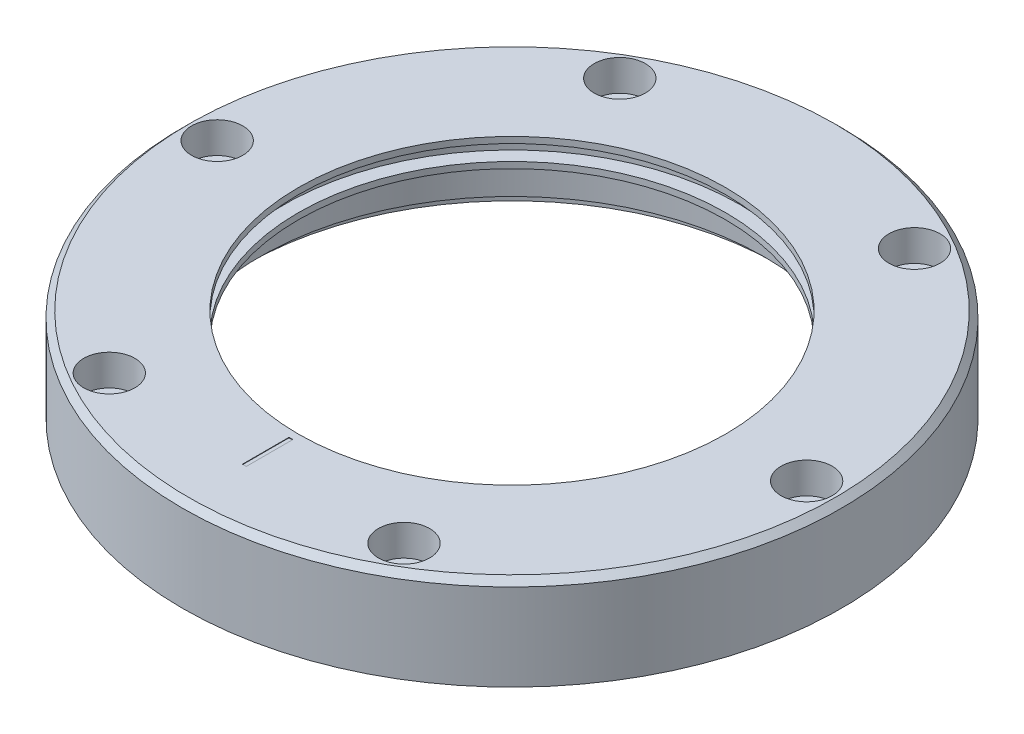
ISO-10303-21;
HEADER;
FILE_DESCRIPTION(('STEP AP214'),'2;1');
FILE_NAME('part.step','',(''),(''),'','','');
FILE_SCHEMA(('AUTOMOTIVE_DESIGN { 1 0 10303 214 1 1 1 1 }'));
ENDSEC;
DATA;
#1=APPLICATION_CONTEXT('core data for automotive mechanical design processes');
#2=APPLICATION_PROTOCOL_DEFINITION('international standard','automotive_design',2000,#1);
#3=PRODUCT_CONTEXT('',#1,'mechanical');
#4=PRODUCT('Part','Part','',(#3));
#5=PRODUCT_RELATED_PRODUCT_CATEGORY('part','',(#4));
#6=PRODUCT_DEFINITION_FORMATION('','',#4);
#7=PRODUCT_DEFINITION_CONTEXT('part definition',#1,'design');
#8=PRODUCT_DEFINITION('design','',#6,#7);
#9=PRODUCT_DEFINITION_SHAPE('','',#8);
#10=(LENGTH_UNIT() NAMED_UNIT(*) SI_UNIT(.MILLI.,.METRE.));
#11=(NAMED_UNIT(*) PLANE_ANGLE_UNIT() SI_UNIT($,.RADIAN.));
#12=(NAMED_UNIT(*) SI_UNIT($,.STERADIAN.) SOLID_ANGLE_UNIT());
#13=UNCERTAINTY_MEASURE_WITH_UNIT(LENGTH_MEASURE(1.E-05),#10,'distance_accuracy_value','');
#14=(GEOMETRIC_REPRESENTATION_CONTEXT(3) GLOBAL_UNCERTAINTY_ASSIGNED_CONTEXT((#13)) GLOBAL_UNIT_ASSIGNED_CONTEXT((#10,
#11,#12)) REPRESENTATION_CONTEXT('',''));
#15=CARTESIAN_POINT('',(0.,0.,0.));
#16=DIRECTION('',(0.,0.,1.));
#17=DIRECTION('',(1.,0.,0.));
#18=AXIS2_PLACEMENT_3D('',#15,#16,#17);
#19=CARTESIAN_POINT('',(-0.0234141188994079,54.2010599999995,-152.4));
#20=DIRECTION('',(0.,-1.,0.));
#21=DIRECTION('',(0.,0.,-1.));
#22=AXIS2_PLACEMENT_3D('',#19,#20,#21);
#23=CYLINDRICAL_SURFACE('',#22,34.9758);
#24=CARTESIAN_POINT('',(-0.0234141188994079,54.7090599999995,-152.4));
#25=DIRECTION('',(0.,-1.,0.));
#26=DIRECTION('',(0.,0.,-1.));
#27=AXIS2_PLACEMENT_3D('',#24,#25,#26);
#28=CIRCLE('',#27,34.9758);
#29=CARTESIAN_POINT('',(-0.0234141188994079,54.7090599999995,-187.3758));
#30=VERTEX_POINT('',#29);
#31=EDGE_CURVE('E20',#30,#30,#28,.T.);
#32=ORIENTED_EDGE('',*,*,#31,.F.);
#33=EDGE_LOOP('',(#32));
#34=FACE_BOUND('',#33,.T.);
#35=CARTESIAN_POINT('',(-0.0234141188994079,53.6930599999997,-152.4));
#36=DIRECTION('',(0.,-1.,0.));
#37=DIRECTION('',(0.,0.,-1.));
#38=AXIS2_PLACEMENT_3D('',#35,#36,#37);
#39=CIRCLE('',#38,34.9758);
#40=CARTESIAN_POINT('',(-0.0234141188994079,53.6930599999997,-187.3758));
#41=VERTEX_POINT('',#40);
#42=EDGE_CURVE('E187',#41,#41,#39,.F.);
#43=ORIENTED_EDGE('',*,*,#42,.F.);
#44=EDGE_LOOP('',(#43));
#45=FACE_BOUND('',#44,.T.);
#46=ADVANCED_FACE('F17',(#34,#45),#23,.F.);
#47=CARTESIAN_POINT('',(37.2637858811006,54.7090599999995,-152.4));
#48=DIRECTION('',(0.,1.,0.));
#49=DIRECTION('',(0.,0.,1.));
#50=AXIS2_PLACEMENT_3D('',#47,#48,#49);
#51=PLANE('',#50);
#52=ORIENTED_EDGE('',*,*,#31,.T.);
#53=EDGE_LOOP('',(#52));
#54=FACE_BOUND('',#53,.T.);
#55=CARTESIAN_POINT('',(-0.0234141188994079,54.7090599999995,-152.4));
#56=DIRECTION('',(0.,-1.,0.));
#57=DIRECTION('',(0.,0.,-1.));
#58=AXIS2_PLACEMENT_3D('',#55,#56,#57);
#59=CIRCLE('',#58,37.2872);
#60=CARTESIAN_POINT('',(-0.0234141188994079,54.7090599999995,-189.6872));
#61=VERTEX_POINT('',#60);
#62=EDGE_CURVE('E185',#61,#61,#59,.F.);
#63=ORIENTED_EDGE('',*,*,#62,.T.);
#64=EDGE_LOOP('',(#63));
#65=FACE_BOUND('',#64,.T.);
#66=ADVANCED_FACE('F194',(#54,#65),#51,.T.);
#67=CARTESIAN_POINT('',(34.9523858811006,53.6930599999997,-152.4));
#68=DIRECTION('',(0.,-1.,0.));
#69=DIRECTION('',(0.,0.,-1.));
#70=AXIS2_PLACEMENT_3D('',#67,#68,#69);
#71=PLANE('',#70);
#72=ORIENTED_EDGE('',*,*,#42,.T.);
#73=EDGE_LOOP('',(#72));
#74=FACE_BOUND('',#73,.T.);
#75=CARTESIAN_POINT('',(-0.0234141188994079,53.6930599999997,-152.4));
#76=DIRECTION('',(0.,-1.,0.));
#77=DIRECTION('',(0.,0.,-1.));
#78=AXIS2_PLACEMENT_3D('',#75,#76,#77);
#79=CIRCLE('',#78,41.2877);
#80=CARTESIAN_POINT('',(-0.0234141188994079,53.6930599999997,-193.6877));
#81=VERTEX_POINT('',#80);
#82=EDGE_CURVE('E87',#81,#81,#79,.T.);
#83=ORIENTED_EDGE('',*,*,#82,.T.);
#84=EDGE_LOOP('',(#83));
#85=FACE_BOUND('',#84,.T.);
#86=ADVANCED_FACE('F203',(#74,#85),#71,.T.);
#87=CARTESIAN_POINT('',(-0.0234141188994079,55.9803299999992,-152.4));
#88=DIRECTION('',(0.,-1.,0.));
#89=DIRECTION('',(0.,0.,-1.));
#90=AXIS2_PLACEMENT_3D('',#87,#88,#89);
#91=CYLINDRICAL_SURFACE('',#90,37.2872);
#92=CARTESIAN_POINT('',(-0.0234141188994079,57.2515999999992,-152.4));
#93=DIRECTION('',(0.,-1.,0.));
#94=DIRECTION('',(0.,0.,-1.));
#95=AXIS2_PLACEMENT_3D('',#92,#93,#94);
#96=CIRCLE('',#95,37.2872);
#97=CARTESIAN_POINT('',(-0.0234141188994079,57.2515999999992,-189.6872));
#98=VERTEX_POINT('',#97);
#99=EDGE_CURVE('E86',#98,#98,#96,.T.);
#100=ORIENTED_EDGE('',*,*,#99,.F.);
#101=EDGE_LOOP('',(#100));
#102=FACE_BOUND('',#101,.T.);
#103=ORIENTED_EDGE('',*,*,#62,.F.);
#104=EDGE_LOOP('',(#103));
#105=FACE_BOUND('',#104,.T.);
#106=ADVANCED_FACE('F328',(#102,#105),#91,.F.);
#107=CARTESIAN_POINT('',(-0.0234141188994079,49.4906299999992,-152.4));
#108=DIRECTION('',(0.,-1.,0.));
#109=DIRECTION('',(0.,0.,-1.));
#110=AXIS2_PLACEMENT_3D('',#107,#108,#109);
#111=CYLINDRICAL_SURFACE('',#110,41.2877);
#112=ORIENTED_EDGE('',*,*,#82,.F.);
#113=EDGE_LOOP('',(#112));
#114=FACE_BOUND('',#113,.T.);
#115=CARTESIAN_POINT('',(-0.0234141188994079,45.288199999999,-152.4));
#116=DIRECTION('',(0.,-1.,0.));
#117=DIRECTION('',(0.,0.,-1.));
#118=AXIS2_PLACEMENT_3D('',#115,#116,#117);
#119=CIRCLE('',#118,41.2877);
#120=CARTESIAN_POINT('',(-0.0234141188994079,45.288199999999,-193.6877));
#121=VERTEX_POINT('',#120);
#122=EDGE_CURVE('E73',#121,#121,#119,.F.);
#123=ORIENTED_EDGE('',*,*,#122,.F.);
#124=EDGE_LOOP('',(#123));
#125=FACE_BOUND('',#124,.T.);
#126=ADVANCED_FACE('F325',(#114,#125),#111,.F.);
#127=CARTESIAN_POINT('',(-0.0234141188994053,58.1913999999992,-112.395));
#128=DIRECTION('',(0.,-1.,0.));
#129=DIRECTION('',(1.,0.,0.));
#130=AXIS2_PLACEMENT_3D('',#127,#128,#129);
#131=PLANE('',#130);
#132=DIRECTION('',(0.,0.,1.));
#133=VECTOR('',#132,1.);
#134=CARTESIAN_POINT('',(-0.340914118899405,58.1913999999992,-108.585));
#135=LINE('',#134,#133);
#136=CARTESIAN_POINT('',(-0.340914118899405,58.1913999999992,-116.205));
#137=VERTEX_POINT('',#136);
#138=CARTESIAN_POINT('',(-0.340914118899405,58.1913999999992,-108.585));
#139=VERTEX_POINT('',#138);
#140=EDGE_CURVE('E61',#137,#139,#135,.T.);
#141=ORIENTED_EDGE('',*,*,#140,.T.);
#142=DIRECTION('',(1.,0.,0.));
#143=VECTOR('',#142,1.);
#144=CARTESIAN_POINT('',(-0.0234141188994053,58.1913999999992,-108.585));
#145=LINE('',#144,#143);
#146=CARTESIAN_POINT('',(0.294085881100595,58.1913999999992,-108.585));
#147=VERTEX_POINT('',#146);
#148=EDGE_CURVE('E84',#147,#139,#145,.F.);
#149=ORIENTED_EDGE('',*,*,#148,.F.);
#150=DIRECTION('',(0.,0.,-1.));
#151=VECTOR('',#150,1.);
#152=CARTESIAN_POINT('',(0.294085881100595,58.1913999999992,-116.205));
#153=LINE('',#152,#151);
#154=CARTESIAN_POINT('',(0.294085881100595,58.1913999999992,-116.205));
#155=VERTEX_POINT('',#154);
#156=EDGE_CURVE('E55',#147,#155,#153,.T.);
#157=ORIENTED_EDGE('',*,*,#156,.T.);
#158=DIRECTION('',(-1.,0.,0.));
#159=VECTOR('',#158,1.);
#160=CARTESIAN_POINT('',(-0.340914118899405,58.1913999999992,-116.205));
#161=LINE('',#160,#159);
#162=EDGE_CURVE('E58',#155,#137,#161,.T.);
#163=ORIENTED_EDGE('',*,*,#162,.T.);
#164=EDGE_LOOP('',(#141,#149,#157,#163));
#165=FACE_BOUND('',#164,.T.);
#166=ADVANCED_FACE('F60',(#165),#131,.F.);
#167=CARTESIAN_POINT('',(34.9523858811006,57.2515999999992,-152.4));
#168=DIRECTION('',(0.,-1.,0.));
#169=DIRECTION('',(0.,0.,-1.));
#170=AXIS2_PLACEMENT_3D('',#167,#168,#169);
#171=PLANE('',#170);
#172=CARTESIAN_POINT('',(-0.0234141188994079,57.2515999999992,-152.4));
#173=DIRECTION('',(0.,-1.,0.));
#174=DIRECTION('',(0.,0.,-1.));
#175=AXIS2_PLACEMENT_3D('',#172,#173,#174);
#176=CIRCLE('',#175,34.9758);
#177=CARTESIAN_POINT('',(-0.0234141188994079,57.2515999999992,-187.3758));
#178=VERTEX_POINT('',#177);
#179=EDGE_CURVE('E158',#178,#178,#176,.F.);
#180=ORIENTED_EDGE('',*,*,#179,.T.);
#181=EDGE_LOOP('',(#180));
#182=FACE_BOUND('',#181,.T.);
#183=ORIENTED_EDGE('',*,*,#99,.T.);
#184=EDGE_LOOP('',(#183));
#185=FACE_BOUND('',#184,.T.);
#186=ADVANCED_FACE('F318',(#182,#185),#171,.T.);
#187=CARTESIAN_POINT('',(24.0959779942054,53.1875999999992,-194.188261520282));
#188=DIRECTION('',(0.,1.,0.));
#189=DIRECTION('',(0.,0.,1.));
#190=AXIS2_PLACEMENT_3D('',#187,#188,#189);
#191=PLANE('',#190);
#192=CARTESIAN_POINT('',(24.0959779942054,53.1875999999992,-194.188261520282));
#193=DIRECTION('',(0.,-1.,0.));
#194=DIRECTION('',(1.,0.,0.));
#195=AXIS2_PLACEMENT_3D('',#192,#193,#194);
#196=CIRCLE('',#195,2.54);
#197=CARTESIAN_POINT('',(26.6359779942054,53.1875999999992,-194.188261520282));
#198=VERTEX_POINT('',#197);
#199=EDGE_CURVE('E155',#198,#198,#196,.T.);
#200=ORIENTED_EDGE('',*,*,#199,.T.);
#201=EDGE_LOOP('',(#200));
#202=FACE_BOUND('',#201,.T.);
#203=CARTESIAN_POINT('',(24.0959779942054,53.1875999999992,-194.188261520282));
#204=DIRECTION('',(0.,-1.,0.));
#205=DIRECTION('',(1.,0.,0.));
#206=AXIS2_PLACEMENT_3D('',#203,#204,#205);
#207=CIRCLE('',#206,4.191);
#208=CARTESIAN_POINT('',(28.2869779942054,53.1875999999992,-194.188261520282));
#209=VERTEX_POINT('',#208);
#210=EDGE_CURVE('E167',#209,#209,#207,.F.);
#211=ORIENTED_EDGE('',*,*,#210,.T.);
#212=EDGE_LOOP('',(#211));
#213=FACE_BOUND('',#212,.T.);
#214=ADVANCED_FACE('F314',(#202,#213),#191,.T.);
#215=CARTESIAN_POINT('',(-24.1640220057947,53.1875999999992,-110.599489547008));
#216=DIRECTION('',(0.,1.,0.));
#217=DIRECTION('',(0.,0.,1.));
#218=AXIS2_PLACEMENT_3D('',#215,#216,#217);
#219=PLANE('',#218);
#220=CARTESIAN_POINT('',(-24.1640220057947,53.1875999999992,-110.599489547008));
#221=DIRECTION('',(0.,-1.,0.));
#222=DIRECTION('',(1.,0.,0.));
#223=AXIS2_PLACEMENT_3D('',#220,#221,#222);
#224=CIRCLE('',#223,2.54);
#225=CARTESIAN_POINT('',(-21.6240220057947,53.1875999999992,-110.599489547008));
#226=VERTEX_POINT('',#225);
#227=EDGE_CURVE('E152',#226,#226,#224,.T.);
#228=ORIENTED_EDGE('',*,*,#227,.T.);
#229=EDGE_LOOP('',(#228));
#230=FACE_BOUND('',#229,.T.);
#231=CARTESIAN_POINT('',(-24.1640220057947,53.1875999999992,-110.599489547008));
#232=DIRECTION('',(0.,-1.,0.));
#233=DIRECTION('',(1.,0.,0.));
#234=AXIS2_PLACEMENT_3D('',#231,#232,#233);
#235=CIRCLE('',#234,4.191);
#236=CARTESIAN_POINT('',(-19.9730220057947,53.1875999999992,-110.599489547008));
#237=VERTEX_POINT('',#236);
#238=EDGE_CURVE('E161',#237,#237,#235,.F.);
#239=ORIENTED_EDGE('',*,*,#238,.T.);
#240=EDGE_LOOP('',(#239));
#241=FACE_BOUND('',#240,.T.);
#242=ADVANCED_FACE('F310',(#230,#241),#219,.T.);
#243=CARTESIAN_POINT('',(-24.1640220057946,53.1875999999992,-194.188261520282));
#244=DIRECTION('',(0.,1.,0.));
#245=DIRECTION('',(0.,0.,1.));
#246=AXIS2_PLACEMENT_3D('',#243,#244,#245);
#247=PLANE('',#246);
#248=CARTESIAN_POINT('',(-24.1640220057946,53.1875999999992,-194.188261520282));
#249=DIRECTION('',(0.,-1.,0.));
#250=DIRECTION('',(1.,0.,0.));
#251=AXIS2_PLACEMENT_3D('',#248,#249,#250);
#252=CIRCLE('',#251,2.54);
#253=CARTESIAN_POINT('',(-21.6240220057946,53.1875999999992,-194.188261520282));
#254=VERTEX_POINT('',#253);
#255=EDGE_CURVE('E149',#254,#254,#252,.T.);
#256=ORIENTED_EDGE('',*,*,#255,.T.);
#257=EDGE_LOOP('',(#256));
#258=FACE_BOUND('',#257,.T.);
#259=CARTESIAN_POINT('',(-24.1640220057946,53.1875999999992,-194.188261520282));
#260=DIRECTION('',(0.,-1.,0.));
#261=DIRECTION('',(1.,0.,0.));
#262=AXIS2_PLACEMENT_3D('',#259,#260,#261);
#263=CIRCLE('',#262,4.191);
#264=CARTESIAN_POINT('',(-19.9730220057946,53.1875999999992,-194.188261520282));
#265=VERTEX_POINT('',#264);
#266=EDGE_CURVE('E176',#265,#265,#263,.F.);
#267=ORIENTED_EDGE('',*,*,#266,.T.);
#268=EDGE_LOOP('',(#267));
#269=FACE_BOUND('',#268,.T.);
#270=ADVANCED_FACE('F306',(#258,#269),#247,.T.);
#271=CARTESIAN_POINT('',(48.2259779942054,53.1875999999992,-152.393875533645));
#272=DIRECTION('',(0.,1.,0.));
#273=DIRECTION('',(0.,0.,1.));
#274=AXIS2_PLACEMENT_3D('',#271,#272,#273);
#275=PLANE('',#274);
#276=CARTESIAN_POINT('',(48.2259779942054,53.1875999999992,-152.393875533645));
#277=DIRECTION('',(0.,-1.,0.));
#278=DIRECTION('',(1.,0.,0.));
#279=AXIS2_PLACEMENT_3D('',#276,#277,#278);
#280=CIRCLE('',#279,2.54);
#281=CARTESIAN_POINT('',(50.7659779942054,53.1875999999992,-152.393875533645));
#282=VERTEX_POINT('',#281);
#283=EDGE_CURVE('E146',#282,#282,#280,.T.);
#284=ORIENTED_EDGE('',*,*,#283,.T.);
#285=EDGE_LOOP('',(#284));
#286=FACE_BOUND('',#285,.T.);
#287=CARTESIAN_POINT('',(48.2259779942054,53.1875999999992,-152.393875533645));
#288=DIRECTION('',(0.,-1.,0.));
#289=DIRECTION('',(1.,0.,0.));
#290=AXIS2_PLACEMENT_3D('',#287,#288,#289);
#291=CIRCLE('',#290,4.191);
#292=CARTESIAN_POINT('',(52.4169779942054,53.1875999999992,-152.393875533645));
#293=VERTEX_POINT('',#292);
#294=EDGE_CURVE('E164',#293,#293,#291,.F.);
#295=ORIENTED_EDGE('',*,*,#294,.T.);
#296=EDGE_LOOP('',(#295));
#297=FACE_BOUND('',#296,.T.);
#298=ADVANCED_FACE('F302',(#286,#297),#275,.T.);
#299=CARTESIAN_POINT('',(24.0959779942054,53.1875999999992,-110.599489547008));
#300=DIRECTION('',(0.,1.,0.));
#301=DIRECTION('',(0.,0.,1.));
#302=AXIS2_PLACEMENT_3D('',#299,#300,#301);
#303=PLANE('',#302);
#304=CARTESIAN_POINT('',(24.0959779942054,53.1875999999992,-110.599489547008));
#305=DIRECTION('',(0.,-1.,0.));
#306=DIRECTION('',(1.,0.,0.));
#307=AXIS2_PLACEMENT_3D('',#304,#305,#306);
#308=CIRCLE('',#307,2.54);
#309=CARTESIAN_POINT('',(26.6359779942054,53.1875999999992,-110.599489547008));
#310=VERTEX_POINT('',#309);
#311=EDGE_CURVE('E143',#310,#310,#308,.T.);
#312=ORIENTED_EDGE('',*,*,#311,.T.);
#313=EDGE_LOOP('',(#312));
#314=FACE_BOUND('',#313,.T.);
#315=CARTESIAN_POINT('',(24.0959779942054,53.1875999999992,-110.599489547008));
#316=DIRECTION('',(0.,-1.,0.));
#317=DIRECTION('',(1.,0.,0.));
#318=AXIS2_PLACEMENT_3D('',#315,#316,#317);
#319=CIRCLE('',#318,4.191);
#320=CARTESIAN_POINT('',(28.2869779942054,53.1875999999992,-110.599489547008));
#321=VERTEX_POINT('',#320);
#322=EDGE_CURVE('E173',#321,#321,#319,.F.);
#323=ORIENTED_EDGE('',*,*,#322,.T.);
#324=EDGE_LOOP('',(#323));
#325=FACE_BOUND('',#324,.T.);
#326=ADVANCED_FACE('F298',(#314,#325),#303,.T.);
#327=CARTESIAN_POINT('',(-48.2940220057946,53.1875999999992,-152.393875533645));
#328=DIRECTION('',(0.,1.,0.));
#329=DIRECTION('',(0.,0.,1.));
#330=AXIS2_PLACEMENT_3D('',#327,#328,#329);
#331=PLANE('',#330);
#332=CARTESIAN_POINT('',(-48.2940220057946,53.1875999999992,-152.393875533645));
#333=DIRECTION('',(0.,-1.,0.));
#334=DIRECTION('',(1.,0.,0.));
#335=AXIS2_PLACEMENT_3D('',#332,#333,#334);
#336=CIRCLE('',#335,2.54);
#337=CARTESIAN_POINT('',(-45.7540220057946,53.1875999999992,-152.393875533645));
#338=VERTEX_POINT('',#337);
#339=EDGE_CURVE('E140',#338,#338,#336,.T.);
#340=ORIENTED_EDGE('',*,*,#339,.T.);
#341=EDGE_LOOP('',(#340));
#342=FACE_BOUND('',#341,.T.);
#343=CARTESIAN_POINT('',(-48.2940220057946,53.1875999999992,-152.393875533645));
#344=DIRECTION('',(0.,-1.,0.));
#345=DIRECTION('',(1.,0.,0.));
#346=AXIS2_PLACEMENT_3D('',#343,#344,#345);
#347=CIRCLE('',#346,4.191);
#348=CARTESIAN_POINT('',(-44.1030220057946,53.1875999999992,-152.393875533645));
#349=VERTEX_POINT('',#348);
#350=EDGE_CURVE('E170',#349,#349,#347,.F.);
#351=ORIENTED_EDGE('',*,*,#350,.T.);
#352=EDGE_LOOP('',(#351));
#353=FACE_BOUND('',#352,.T.);
#354=ADVANCED_FACE('F294',(#342,#353),#331,.T.);
#355=CARTESIAN_POINT('',(41.2642858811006,45.288199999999,-152.4));
#356=DIRECTION('',(0.,-1.,0.));
#357=DIRECTION('',(0.,0.,-1.));
#358=AXIS2_PLACEMENT_3D('',#355,#356,#357);
#359=PLANE('',#358);
#360=ORIENTED_EDGE('',*,*,#122,.T.);
#361=EDGE_LOOP('',(#360));
#362=FACE_BOUND('',#361,.T.);
#363=CARTESIAN_POINT('',(-0.0234141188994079,45.288199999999,-152.4));
#364=DIRECTION('',(0.,-1.,0.));
#365=DIRECTION('',(0.,0.,-1.));
#366=AXIS2_PLACEMENT_3D('',#363,#364,#365);
#367=CIRCLE('',#366,43.5737);
#368=CARTESIAN_POINT('',(-0.0234141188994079,45.288199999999,-195.9737));
#369=VERTEX_POINT('',#368);
#370=EDGE_CURVE('E136',#369,#369,#367,.T.);
#371=ORIENTED_EDGE('',*,*,#370,.T.);
#372=EDGE_LOOP('',(#371));
#373=FACE_BOUND('',#372,.T.);
#374=ADVANCED_FACE('F291',(#362,#373),#359,.T.);
#375=CARTESIAN_POINT('',(-0.340914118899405,58.2675999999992,-108.585));
#376=DIRECTION('',(-1.,0.,0.));
#377=DIRECTION('',(0.,0.,1.));
#378=AXIS2_PLACEMENT_3D('',#375,#376,#377);
#379=PLANE('',#378);
#380=DIRECTION('',(0.,1.,0.));
#381=VECTOR('',#380,1.);
#382=CARTESIAN_POINT('',(-0.340914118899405,58.2675999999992,-108.585));
#383=LINE('',#382,#381);
#384=CARTESIAN_POINT('',(-0.340914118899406,58.2675999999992,-108.585));
#385=VERTEX_POINT('',#384);
#386=EDGE_CURVE('E72',#385,#139,#383,.F.);
#387=ORIENTED_EDGE('',*,*,#386,.T.);
#388=ORIENTED_EDGE('',*,*,#140,.F.);
#389=DIRECTION('',(0.,1.,0.));
#390=VECTOR('',#389,1.);
#391=CARTESIAN_POINT('',(-0.340914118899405,58.2675999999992,-116.205));
#392=LINE('',#391,#390);
#393=CARTESIAN_POINT('',(-0.340914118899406,58.2675999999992,-116.205));
#394=VERTEX_POINT('',#393);
#395=EDGE_CURVE('E66',#137,#394,#392,.T.);
#396=ORIENTED_EDGE('',*,*,#395,.T.);
#397=DIRECTION('',(0.,0.,1.));
#398=VECTOR('',#397,1.);
#399=CARTESIAN_POINT('',(-0.340914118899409,58.2675999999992,-152.4));
#400=LINE('',#399,#398);
#401=EDGE_CURVE('E139',#385,#394,#400,.F.);
#402=ORIENTED_EDGE('',*,*,#401,.F.);
#403=EDGE_LOOP('',(#387,#388,#396,#402));
#404=FACE_BOUND('',#403,.T.);
#405=ADVANCED_FACE('F69',(#404),#379,.F.);
#406=CARTESIAN_POINT('',(-0.340914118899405,58.2675999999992,-116.205));
#407=DIRECTION('',(0.,0.,-1.));
#408=DIRECTION('',(-1.,0.,0.));
#409=AXIS2_PLACEMENT_3D('',#406,#407,#408);
#410=PLANE('',#409);
#411=ORIENTED_EDGE('',*,*,#395,.F.);
#412=ORIENTED_EDGE('',*,*,#162,.F.);
#413=DIRECTION('',(0.,1.,0.));
#414=VECTOR('',#413,1.);
#415=CARTESIAN_POINT('',(0.294085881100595,58.2675999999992,-116.205));
#416=LINE('',#415,#414);
#417=CARTESIAN_POINT('',(0.294085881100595,58.2675999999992,-116.205));
#418=VERTEX_POINT('',#417);
#419=EDGE_CURVE('E80',#155,#418,#416,.T.);
#420=ORIENTED_EDGE('',*,*,#419,.T.);
#421=DIRECTION('',(1.,0.,0.));
#422=VECTOR('',#421,1.);
#423=CARTESIAN_POINT('',(52.9228858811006,58.2675999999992,-116.205));
#424=LINE('',#423,#422);
#425=EDGE_CURVE('E77',#394,#418,#424,.T.);
#426=ORIENTED_EDGE('',*,*,#425,.F.);
#427=EDGE_LOOP('',(#411,#412,#420,#426));
#428=FACE_BOUND('',#427,.T.);
#429=ADVANCED_FACE('F75',(#428),#410,.F.);
#430=CARTESIAN_POINT('',(0.294085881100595,58.2675999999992,-116.205));
#431=DIRECTION('',(1.,0.,0.));
#432=DIRECTION('',(0.,0.,-1.));
#433=AXIS2_PLACEMENT_3D('',#430,#431,#432);
#434=PLANE('',#433);
#435=ORIENTED_EDGE('',*,*,#419,.F.);
#436=ORIENTED_EDGE('',*,*,#156,.F.);
#437=DIRECTION('',(0.,1.,0.));
#438=VECTOR('',#437,1.);
#439=CARTESIAN_POINT('',(0.294085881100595,58.2675999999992,-108.585));
#440=LINE('',#439,#438);
#441=CARTESIAN_POINT('',(0.294085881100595,58.2675999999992,-108.585));
#442=VERTEX_POINT('',#441);
#443=EDGE_CURVE('E35',#147,#442,#440,.T.);
#444=ORIENTED_EDGE('',*,*,#443,.T.);
#445=DIRECTION('',(0.,0.,1.));
#446=VECTOR('',#445,1.);
#447=CARTESIAN_POINT('',(0.294085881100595,58.2675999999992,-152.4));
#448=LINE('',#447,#446);
#449=EDGE_CURVE('E375',#418,#442,#448,.T.);
#450=ORIENTED_EDGE('',*,*,#449,.F.);
#451=EDGE_LOOP('',(#435,#436,#444,#450));
#452=FACE_BOUND('',#451,.T.);
#453=ADVANCED_FACE('F283',(#452),#434,.F.);
#454=CARTESIAN_POINT('',(0.294085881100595,58.2675999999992,-108.585));
#455=DIRECTION('',(0.,0.,1.));
#456=DIRECTION('',(1.,0.,0.));
#457=AXIS2_PLACEMENT_3D('',#454,#455,#456);
#458=PLANE('',#457);
#459=ORIENTED_EDGE('',*,*,#443,.F.);
#460=ORIENTED_EDGE('',*,*,#148,.T.);
#461=ORIENTED_EDGE('',*,*,#386,.F.);
#462=DIRECTION('',(1.,0.,0.));
#463=VECTOR('',#462,1.);
#464=CARTESIAN_POINT('',(52.9228858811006,58.2675999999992,-108.585));
#465=LINE('',#464,#463);
#466=EDGE_CURVE('E135',#442,#385,#465,.F.);
#467=ORIENTED_EDGE('',*,*,#466,.F.);
#468=EDGE_LOOP('',(#459,#460,#461,#467));
#469=FACE_BOUND('',#468,.T.);
#470=ADVANCED_FACE('F279',(#469),#458,.F.);
#471=CARTESIAN_POINT('',(-24.1640220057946,58.2675999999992,-194.188261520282));
#472=DIRECTION('',(0.,-1.,0.));
#473=DIRECTION('',(1.,0.,0.));
#474=AXIS2_PLACEMENT_3D('',#471,#472,#473);
#475=CYLINDRICAL_SURFACE('',#474,4.191);
#476=ORIENTED_EDGE('',*,*,#266,.F.);
#477=EDGE_LOOP('',(#476));
#478=FACE_BOUND('',#477,.T.);
#479=CARTESIAN_POINT('',(-24.1640220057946,58.2675999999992,-194.188261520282));
#480=DIRECTION('',(0.,-1.,0.));
#481=DIRECTION('',(1.,0.,0.));
#482=AXIS2_PLACEMENT_3D('',#479,#480,#481);
#483=CIRCLE('',#482,4.191);
#484=CARTESIAN_POINT('',(-19.9730220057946,58.2675999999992,-194.188261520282));
#485=VERTEX_POINT('',#484);
#486=EDGE_CURVE('E132',#485,#485,#483,.T.);
#487=ORIENTED_EDGE('',*,*,#486,.F.);
#488=EDGE_LOOP('',(#487));
#489=FACE_BOUND('',#488,.T.);
#490=ADVANCED_FACE('F275',(#478,#489),#475,.F.);
#491=CARTESIAN_POINT('',(24.0959779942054,58.2675999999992,-110.599489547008));
#492=DIRECTION('',(0.,-1.,0.));
#493=DIRECTION('',(1.,0.,0.));
#494=AXIS2_PLACEMENT_3D('',#491,#492,#493);
#495=CYLINDRICAL_SURFACE('',#494,4.191);
#496=ORIENTED_EDGE('',*,*,#322,.F.);
#497=EDGE_LOOP('',(#496));
#498=FACE_BOUND('',#497,.T.);
#499=CARTESIAN_POINT('',(24.0959779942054,58.2675999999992,-110.599489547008));
#500=DIRECTION('',(0.,-1.,0.));
#501=DIRECTION('',(1.,0.,0.));
#502=AXIS2_PLACEMENT_3D('',#499,#500,#501);
#503=CIRCLE('',#502,4.191);
#504=CARTESIAN_POINT('',(28.2869779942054,58.2675999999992,-110.599489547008));
#505=VERTEX_POINT('',#504);
#506=EDGE_CURVE('E129',#505,#505,#503,.T.);
#507=ORIENTED_EDGE('',*,*,#506,.F.);
#508=EDGE_LOOP('',(#507));
#509=FACE_BOUND('',#508,.T.);
#510=ADVANCED_FACE('F271',(#498,#509),#495,.F.);
#511=CARTESIAN_POINT('',(-48.2940220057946,58.2675999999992,-152.393875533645));
#512=DIRECTION('',(0.,-1.,0.));
#513=DIRECTION('',(1.,0.,0.));
#514=AXIS2_PLACEMENT_3D('',#511,#512,#513);
#515=CYLINDRICAL_SURFACE('',#514,4.191);
#516=ORIENTED_EDGE('',*,*,#350,.F.);
#517=EDGE_LOOP('',(#516));
#518=FACE_BOUND('',#517,.T.);
#519=CARTESIAN_POINT('',(-48.2940220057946,58.2675999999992,-152.393875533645));
#520=DIRECTION('',(0.,-1.,0.));
#521=DIRECTION('',(1.,0.,0.));
#522=AXIS2_PLACEMENT_3D('',#519,#520,#521);
#523=CIRCLE('',#522,4.191);
#524=CARTESIAN_POINT('',(-44.1030220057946,58.2675999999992,-152.393875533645));
#525=VERTEX_POINT('',#524);
#526=EDGE_CURVE('E126',#525,#525,#523,.T.);
#527=ORIENTED_EDGE('',*,*,#526,.F.);
#528=EDGE_LOOP('',(#527));
#529=FACE_BOUND('',#528,.T.);
#530=ADVANCED_FACE('F267',(#518,#529),#515,.F.);
#531=CARTESIAN_POINT('',(24.0959779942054,58.2675999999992,-194.188261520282));
#532=DIRECTION('',(0.,-1.,0.));
#533=DIRECTION('',(1.,0.,0.));
#534=AXIS2_PLACEMENT_3D('',#531,#532,#533);
#535=CYLINDRICAL_SURFACE('',#534,4.191);
#536=ORIENTED_EDGE('',*,*,#210,.F.);
#537=EDGE_LOOP('',(#536));
#538=FACE_BOUND('',#537,.T.);
#539=CARTESIAN_POINT('',(24.0959779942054,58.2675999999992,-194.188261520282));
#540=DIRECTION('',(0.,-1.,0.));
#541=DIRECTION('',(1.,0.,0.));
#542=AXIS2_PLACEMENT_3D('',#539,#540,#541);
#543=CIRCLE('',#542,4.191);
#544=CARTESIAN_POINT('',(28.2869779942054,58.2675999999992,-194.188261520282));
#545=VERTEX_POINT('',#544);
#546=EDGE_CURVE('E123',#545,#545,#543,.T.);
#547=ORIENTED_EDGE('',*,*,#546,.F.);
#548=EDGE_LOOP('',(#547));
#549=FACE_BOUND('',#548,.T.);
#550=ADVANCED_FACE('F263',(#538,#549),#535,.F.);
#551=CARTESIAN_POINT('',(48.2259779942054,58.2675999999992,-152.393875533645));
#552=DIRECTION('',(0.,-1.,0.));
#553=DIRECTION('',(1.,0.,0.));
#554=AXIS2_PLACEMENT_3D('',#551,#552,#553);
#555=CYLINDRICAL_SURFACE('',#554,4.191);
#556=ORIENTED_EDGE('',*,*,#294,.F.);
#557=EDGE_LOOP('',(#556));
#558=FACE_BOUND('',#557,.T.);
#559=CARTESIAN_POINT('',(48.2259779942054,58.2675999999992,-152.393875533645));
#560=DIRECTION('',(0.,-1.,0.));
#561=DIRECTION('',(1.,0.,0.));
#562=AXIS2_PLACEMENT_3D('',#559,#560,#561);
#563=CIRCLE('',#562,4.191);
#564=CARTESIAN_POINT('',(52.4169779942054,58.2675999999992,-152.393875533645));
#565=VERTEX_POINT('',#564);
#566=EDGE_CURVE('E120',#565,#565,#563,.T.);
#567=ORIENTED_EDGE('',*,*,#566,.F.);
#568=EDGE_LOOP('',(#567));
#569=FACE_BOUND('',#568,.T.);
#570=ADVANCED_FACE('F259',(#558,#569),#555,.F.);
#571=CARTESIAN_POINT('',(-24.1640220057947,58.2675999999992,-110.599489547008));
#572=DIRECTION('',(0.,-1.,0.));
#573=DIRECTION('',(1.,0.,0.));
#574=AXIS2_PLACEMENT_3D('',#571,#572,#573);
#575=CYLINDRICAL_SURFACE('',#574,4.191);
#576=ORIENTED_EDGE('',*,*,#238,.F.);
#577=EDGE_LOOP('',(#576));
#578=FACE_BOUND('',#577,.T.);
#579=CARTESIAN_POINT('',(-24.1640220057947,58.2675999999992,-110.599489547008));
#580=DIRECTION('',(0.,-1.,0.));
#581=DIRECTION('',(1.,0.,0.));
#582=AXIS2_PLACEMENT_3D('',#579,#580,#581);
#583=CIRCLE('',#582,4.191);
#584=CARTESIAN_POINT('',(-19.9730220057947,58.2675999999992,-110.599489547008));
#585=VERTEX_POINT('',#584);
#586=EDGE_CURVE('E117',#585,#585,#583,.T.);
#587=ORIENTED_EDGE('',*,*,#586,.F.);
#588=EDGE_LOOP('',(#587));
#589=FACE_BOUND('',#588,.T.);
#590=ADVANCED_FACE('F255',(#578,#589),#575,.F.);
#591=CARTESIAN_POINT('',(-0.0234141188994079,57.7595999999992,-152.4));
#592=DIRECTION('',(0.,-1.,0.));
#593=DIRECTION('',(0.,0.,-1.));
#594=AXIS2_PLACEMENT_3D('',#591,#592,#593);
#595=CYLINDRICAL_SURFACE('',#594,34.9758);
#596=CARTESIAN_POINT('',(-0.0234141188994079,58.2675999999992,-152.4));
#597=DIRECTION('',(0.,-1.,0.));
#598=DIRECTION('',(0.,0.,-1.));
#599=AXIS2_PLACEMENT_3D('',#596,#597,#598);
#600=CIRCLE('',#599,34.9758);
#601=CARTESIAN_POINT('',(-0.0234141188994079,58.2675999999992,-187.3758));
#602=VERTEX_POINT('',#601);
#603=EDGE_CURVE('E114',#602,#602,#600,.T.);
#604=ORIENTED_EDGE('',*,*,#603,.F.);
#605=EDGE_LOOP('',(#604));
#606=FACE_BOUND('',#605,.T.);
#607=ORIENTED_EDGE('',*,*,#179,.F.);
#608=EDGE_LOOP('',(#607));
#609=FACE_BOUND('',#608,.T.);
#610=ADVANCED_FACE('F251',(#606,#609),#595,.F.);
#611=CARTESIAN_POINT('',(24.0959779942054,58.2675999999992,-194.188261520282));
#612=DIRECTION('',(0.,-1.,0.));
#613=DIRECTION('',(1.,0.,0.));
#614=AXIS2_PLACEMENT_3D('',#611,#612,#613);
#615=CYLINDRICAL_SURFACE('',#614,2.54);
#616=CARTESIAN_POINT('',(24.0959779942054,43.0529999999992,-194.188261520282));
#617=DIRECTION('',(0.,-1.,0.));
#618=DIRECTION('',(1.,0.,0.));
#619=AXIS2_PLACEMENT_3D('',#616,#617,#618);
#620=CIRCLE('',#619,2.54);
#621=CARTESIAN_POINT('',(26.6359779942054,43.0529999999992,-194.188261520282));
#622=VERTEX_POINT('',#621);
#623=EDGE_CURVE('E111',#622,#622,#620,.F.);
#624=ORIENTED_EDGE('',*,*,#623,.F.);
#625=EDGE_LOOP('',(#624));
#626=FACE_BOUND('',#625,.T.);
#627=ORIENTED_EDGE('',*,*,#199,.F.);
#628=EDGE_LOOP('',(#627));
#629=FACE_BOUND('',#628,.T.);
#630=ADVANCED_FACE('F247',(#626,#629),#615,.F.);
#631=CARTESIAN_POINT('',(-24.1640220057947,58.2675999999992,-110.599489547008));
#632=DIRECTION('',(0.,-1.,0.));
#633=DIRECTION('',(1.,0.,0.));
#634=AXIS2_PLACEMENT_3D('',#631,#632,#633);
#635=CYLINDRICAL_SURFACE('',#634,2.54);
#636=CARTESIAN_POINT('',(-24.1640220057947,43.0529999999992,-110.599489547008));
#637=DIRECTION('',(0.,-1.,0.));
#638=DIRECTION('',(1.,0.,0.));
#639=AXIS2_PLACEMENT_3D('',#636,#637,#638);
#640=CIRCLE('',#639,2.54);
#641=CARTESIAN_POINT('',(-21.6240220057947,43.0529999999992,-110.599489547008));
#642=VERTEX_POINT('',#641);
#643=EDGE_CURVE('E108',#642,#642,#640,.F.);
#644=ORIENTED_EDGE('',*,*,#643,.F.);
#645=EDGE_LOOP('',(#644));
#646=FACE_BOUND('',#645,.T.);
#647=ORIENTED_EDGE('',*,*,#227,.F.);
#648=EDGE_LOOP('',(#647));
#649=FACE_BOUND('',#648,.T.);
#650=ADVANCED_FACE('F243',(#646,#649),#635,.F.);
#651=CARTESIAN_POINT('',(-24.1640220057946,58.2675999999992,-194.188261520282));
#652=DIRECTION('',(0.,-1.,0.));
#653=DIRECTION('',(1.,0.,0.));
#654=AXIS2_PLACEMENT_3D('',#651,#652,#653);
#655=CYLINDRICAL_SURFACE('',#654,2.54);
#656=CARTESIAN_POINT('',(-24.1640220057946,43.0529999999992,-194.188261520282));
#657=DIRECTION('',(0.,-1.,0.));
#658=DIRECTION('',(1.,0.,0.));
#659=AXIS2_PLACEMENT_3D('',#656,#657,#658);
#660=CIRCLE('',#659,2.54);
#661=CARTESIAN_POINT('',(-21.6240220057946,43.0529999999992,-194.188261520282));
#662=VERTEX_POINT('',#661);
#663=EDGE_CURVE('E105',#662,#662,#660,.F.);
#664=ORIENTED_EDGE('',*,*,#663,.F.);
#665=EDGE_LOOP('',(#664));
#666=FACE_BOUND('',#665,.T.);
#667=ORIENTED_EDGE('',*,*,#255,.F.);
#668=EDGE_LOOP('',(#667));
#669=FACE_BOUND('',#668,.T.);
#670=ADVANCED_FACE('F239',(#666,#669),#655,.F.);
#671=CARTESIAN_POINT('',(48.2259779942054,58.2675999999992,-152.393875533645));
#672=DIRECTION('',(0.,-1.,0.));
#673=DIRECTION('',(1.,0.,0.));
#674=AXIS2_PLACEMENT_3D('',#671,#672,#673);
#675=CYLINDRICAL_SURFACE('',#674,2.54);
#676=CARTESIAN_POINT('',(48.2259779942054,43.0529999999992,-152.393875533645));
#677=DIRECTION('',(0.,-1.,0.));
#678=DIRECTION('',(1.,0.,0.));
#679=AXIS2_PLACEMENT_3D('',#676,#677,#678);
#680=CIRCLE('',#679,2.54);
#681=CARTESIAN_POINT('',(50.7659779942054,43.0529999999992,-152.393875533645));
#682=VERTEX_POINT('',#681);
#683=EDGE_CURVE('E102',#682,#682,#680,.F.);
#684=ORIENTED_EDGE('',*,*,#683,.F.);
#685=EDGE_LOOP('',(#684));
#686=FACE_BOUND('',#685,.T.);
#687=ORIENTED_EDGE('',*,*,#283,.F.);
#688=EDGE_LOOP('',(#687));
#689=FACE_BOUND('',#688,.T.);
#690=ADVANCED_FACE('F235',(#686,#689),#675,.F.);
#691=CARTESIAN_POINT('',(24.0959779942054,58.2675999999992,-110.599489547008));
#692=DIRECTION('',(0.,-1.,0.));
#693=DIRECTION('',(1.,0.,0.));
#694=AXIS2_PLACEMENT_3D('',#691,#692,#693);
#695=CYLINDRICAL_SURFACE('',#694,2.54);
#696=CARTESIAN_POINT('',(24.0959779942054,43.0529999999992,-110.599489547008));
#697=DIRECTION('',(0.,-1.,0.));
#698=DIRECTION('',(1.,0.,0.));
#699=AXIS2_PLACEMENT_3D('',#696,#697,#698);
#700=CIRCLE('',#699,2.54);
#701=CARTESIAN_POINT('',(26.6359779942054,43.0529999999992,-110.599489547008));
#702=VERTEX_POINT('',#701);
#703=EDGE_CURVE('E99',#702,#702,#700,.F.);
#704=ORIENTED_EDGE('',*,*,#703,.F.);
#705=EDGE_LOOP('',(#704));
#706=FACE_BOUND('',#705,.T.);
#707=ORIENTED_EDGE('',*,*,#311,.F.);
#708=EDGE_LOOP('',(#707));
#709=FACE_BOUND('',#708,.T.);
#710=ADVANCED_FACE('F231',(#706,#709),#695,.F.);
#711=CARTESIAN_POINT('',(-48.2940220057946,58.2675999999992,-152.393875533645));
#712=DIRECTION('',(0.,-1.,0.));
#713=DIRECTION('',(1.,0.,0.));
#714=AXIS2_PLACEMENT_3D('',#711,#712,#713);
#715=CYLINDRICAL_SURFACE('',#714,2.54);
#716=CARTESIAN_POINT('',(-48.2940220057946,43.0529999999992,-152.393875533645));
#717=DIRECTION('',(0.,-1.,0.));
#718=DIRECTION('',(1.,0.,0.));
#719=AXIS2_PLACEMENT_3D('',#716,#717,#718);
#720=CIRCLE('',#719,2.54);
#721=CARTESIAN_POINT('',(-45.7540220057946,43.0529999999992,-152.393875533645));
#722=VERTEX_POINT('',#721);
#723=EDGE_CURVE('E96',#722,#722,#720,.F.);
#724=ORIENTED_EDGE('',*,*,#723,.F.);
#725=EDGE_LOOP('',(#724));
#726=FACE_BOUND('',#725,.T.);
#727=ORIENTED_EDGE('',*,*,#339,.F.);
#728=EDGE_LOOP('',(#727));
#729=FACE_BOUND('',#728,.T.);
#730=ADVANCED_FACE('F227',(#726,#729),#715,.F.);
#731=CARTESIAN_POINT('',(-0.0234141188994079,44.1705999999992,-152.4));
#732=DIRECTION('',(0.,-1.,0.));
#733=DIRECTION('',(0.,0.,-1.));
#734=AXIS2_PLACEMENT_3D('',#731,#732,#733);
#735=CYLINDRICAL_SURFACE('',#734,43.5737);
#736=ORIENTED_EDGE('',*,*,#370,.F.);
#737=EDGE_LOOP('',(#736));
#738=FACE_BOUND('',#737,.T.);
#739=CARTESIAN_POINT('',(-0.0234141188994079,43.0529999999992,-152.4));
#740=DIRECTION('',(0.,-1.,0.));
#741=DIRECTION('',(0.,0.,-1.));
#742=AXIS2_PLACEMENT_3D('',#739,#740,#741);
#743=CIRCLE('',#742,43.5737);
#744=CARTESIAN_POINT('',(-0.0234141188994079,43.0529999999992,-195.9737));
#745=VERTEX_POINT('',#744);
#746=EDGE_CURVE('E93',#745,#745,#743,.F.);
#747=ORIENTED_EDGE('',*,*,#746,.F.);
#748=EDGE_LOOP('',(#747));
#749=FACE_BOUND('',#748,.T.);
#750=ADVANCED_FACE('F223',(#738,#749),#735,.F.);
#751=CARTESIAN_POINT('',(52.9228858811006,58.2675999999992,-152.4));
#752=DIRECTION('',(0.,1.,0.));
#753=DIRECTION('',(0.,0.,1.));
#754=AXIS2_PLACEMENT_3D('',#751,#752,#753);
#755=PLANE('',#754);
#756=ORIENTED_EDGE('',*,*,#603,.T.);
#757=EDGE_LOOP('',(#756));
#758=FACE_BOUND('',#757,.T.);
#759=ORIENTED_EDGE('',*,*,#586,.T.);
#760=EDGE_LOOP('',(#759));
#761=FACE_BOUND('',#760,.T.);
#762=ORIENTED_EDGE('',*,*,#566,.T.);
#763=EDGE_LOOP('',(#762));
#764=FACE_BOUND('',#763,.T.);
#765=ORIENTED_EDGE('',*,*,#546,.T.);
#766=EDGE_LOOP('',(#765));
#767=FACE_BOUND('',#766,.T.);
#768=ORIENTED_EDGE('',*,*,#526,.T.);
#769=EDGE_LOOP('',(#768));
#770=FACE_BOUND('',#769,.T.);
#771=ORIENTED_EDGE('',*,*,#506,.T.);
#772=EDGE_LOOP('',(#771));
#773=FACE_BOUND('',#772,.T.);
#774=ORIENTED_EDGE('',*,*,#486,.T.);
#775=EDGE_LOOP('',(#774));
#776=FACE_BOUND('',#775,.T.);
#777=ORIENTED_EDGE('',*,*,#449,.T.);
#778=ORIENTED_EDGE('',*,*,#466,.T.);
#779=ORIENTED_EDGE('',*,*,#401,.T.);
#780=ORIENTED_EDGE('',*,*,#425,.T.);
#781=EDGE_LOOP('',(#777,#778,#779,#780));
#782=FACE_BOUND('',#781,.T.);
#783=CARTESIAN_POINT('',(-0.0234141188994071,58.2675999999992,-152.4));
#784=DIRECTION('',(0.,-1.,0.));
#785=DIRECTION('',(0.,0.,-1.));
#786=AXIS2_PLACEMENT_3D('',#783,#784,#785);
#787=CIRCLE('',#786,52.9463);
#788=CARTESIAN_POINT('',(-0.0234141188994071,58.2675999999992,-205.3463));
#789=VERTEX_POINT('',#788);
#790=EDGE_CURVE('E90',#789,#789,#787,.T.);
#791=ORIENTED_EDGE('',*,*,#790,.F.);
#792=EDGE_LOOP('',(#791));
#793=FACE_BOUND('',#792,.T.);
#794=ADVANCED_FACE('F219',(#758,#761,#764,#767,#770,#773,#776,#782,#793),#755,.T.);
#795=CARTESIAN_POINT('',(43.5502858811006,43.0529999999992,-152.4));
#796=DIRECTION('',(0.,-1.,0.));
#797=DIRECTION('',(0.,0.,-1.));
#798=AXIS2_PLACEMENT_3D('',#795,#796,#797);
#799=PLANE('',#798);
#800=ORIENTED_EDGE('',*,*,#746,.T.);
#801=EDGE_LOOP('',(#800));
#802=FACE_BOUND('',#801,.T.);
#803=ORIENTED_EDGE('',*,*,#723,.T.);
#804=EDGE_LOOP('',(#803));
#805=FACE_BOUND('',#804,.T.);
#806=ORIENTED_EDGE('',*,*,#703,.T.);
#807=EDGE_LOOP('',(#806));
#808=FACE_BOUND('',#807,.T.);
#809=ORIENTED_EDGE('',*,*,#683,.T.);
#810=EDGE_LOOP('',(#809));
#811=FACE_BOUND('',#810,.T.);
#812=ORIENTED_EDGE('',*,*,#663,.T.);
#813=EDGE_LOOP('',(#812));
#814=FACE_BOUND('',#813,.T.);
#815=ORIENTED_EDGE('',*,*,#643,.T.);
#816=EDGE_LOOP('',(#815));
#817=FACE_BOUND('',#816,.T.);
#818=ORIENTED_EDGE('',*,*,#623,.T.);
#819=EDGE_LOOP('',(#818));
#820=FACE_BOUND('',#819,.T.);
#821=CARTESIAN_POINT('',(-0.0234141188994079,43.0529999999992,-152.4));
#822=DIRECTION('',(0.,-1.,0.));
#823=DIRECTION('',(0.,0.,-1.));
#824=AXIS2_PLACEMENT_3D('',#821,#822,#823);
#825=CIRCLE('',#824,53.9623);
#826=CARTESIAN_POINT('',(-0.0234141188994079,43.0529999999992,-206.3623));
#827=VERTEX_POINT('',#826);
#828=EDGE_CURVE('E26',#827,#827,#825,.F.);
#829=ORIENTED_EDGE('',*,*,#828,.F.);
#830=EDGE_LOOP('',(#829));
#831=FACE_BOUND('',#830,.T.);
#832=ADVANCED_FACE('F212',(#802,#805,#808,#811,#814,#817,#820,#831),#799,.T.);
#833=CARTESIAN_POINT('',(-0.0234141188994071,57.2515999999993,-152.4));
#834=DIRECTION('',(0.,-1.,0.));
#835=DIRECTION('',(0.,0.,-1.));
#836=AXIS2_PLACEMENT_3D('',#833,#834,#835);
#837=CONICAL_SURFACE('',#836,53.9623,0.785398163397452);
#838=ORIENTED_EDGE('',*,*,#790,.T.);
#839=EDGE_LOOP('',(#838));
#840=FACE_BOUND('',#839,.T.);
#841=CARTESIAN_POINT('',(-0.0234141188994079,57.2515999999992,-152.4));
#842=DIRECTION('',(0.,-1.,0.));
#843=DIRECTION('',(0.,0.,-1.));
#844=AXIS2_PLACEMENT_3D('',#841,#842,#843);
#845=CIRCLE('',#844,53.9623);
#846=CARTESIAN_POINT('',(-0.0234141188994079,57.2515999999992,-206.3623));
#847=VERTEX_POINT('',#846);
#848=EDGE_CURVE('E11',#847,#847,#845,.T.);
#849=ORIENTED_EDGE('',*,*,#848,.F.);
#850=EDGE_LOOP('',(#849));
#851=FACE_BOUND('',#850,.T.);
#852=ADVANCED_FACE('F206',(#840,#851),#837,.T.);
#853=CARTESIAN_POINT('',(-0.0234141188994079,50.1522999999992,-152.4));
#854=DIRECTION('',(0.,-1.,0.));
#855=DIRECTION('',(0.,0.,-1.));
#856=AXIS2_PLACEMENT_3D('',#853,#854,#855);
#857=CYLINDRICAL_SURFACE('',#856,53.9623);
#858=ORIENTED_EDGE('',*,*,#848,.T.);
#859=EDGE_LOOP('',(#858));
#860=FACE_BOUND('',#859,.T.);
#861=ORIENTED_EDGE('',*,*,#828,.T.);
#862=EDGE_LOOP('',(#861));
#863=FACE_BOUND('',#862,.T.);
#864=ADVANCED_FACE('F204',(#860,#863),#857,.T.);
#865=CLOSED_SHELL('',(#46,#66,#86,#106,#126,#166,#186,#214,#242,#270,#298,#326,#354,#374,#405,
#429,#453,#470,#490,#510,#530,#550,#570,#590,#610,#630,#650,#670,#690,#710,#730,#750,#794,#832,
#852,#864));
#866=MANIFOLD_SOLID_BREP('B1',#865);
#867=ADVANCED_BREP_SHAPE_REPRESENTATION('',(#18,#866),#14);
#868=SHAPE_DEFINITION_REPRESENTATION(#9,#867);
ENDSEC;
END-ISO-10303-21;
